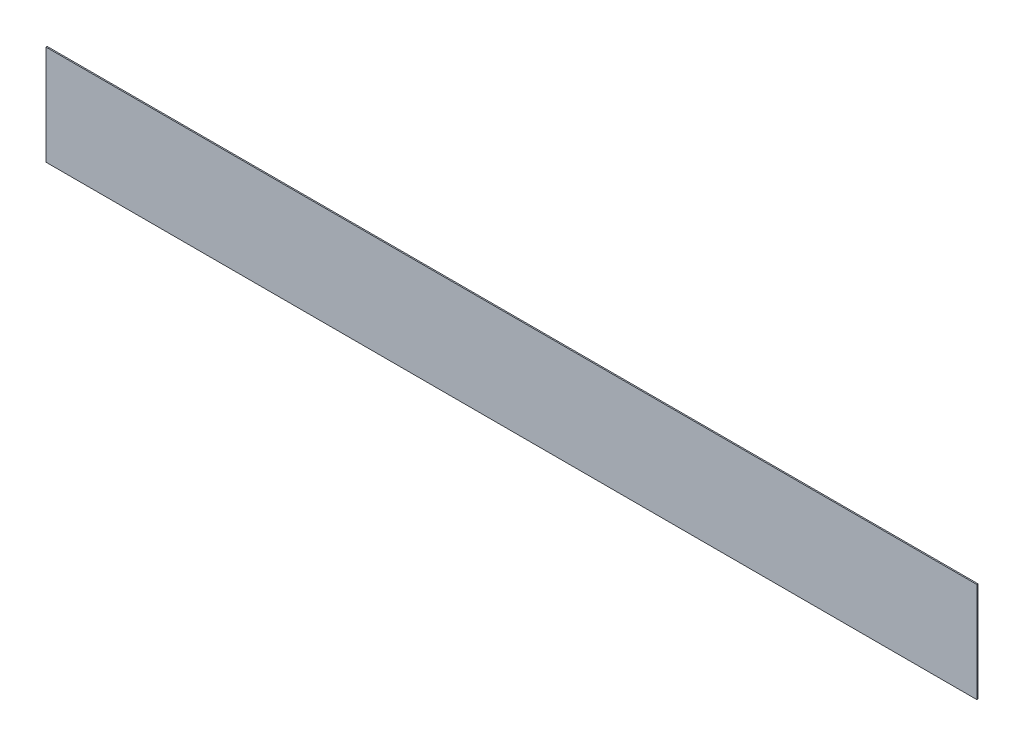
ISO-10303-21;
HEADER;
FILE_DESCRIPTION(('STEP AP214'),'2;1');
FILE_NAME('part.step','',(''),(''),'','','');
FILE_SCHEMA(('AUTOMOTIVE_DESIGN { 1 0 10303 214 1 1 1 1 }'));
ENDSEC;
DATA;
#1=APPLICATION_CONTEXT('core data for automotive mechanical design processes');
#2=APPLICATION_PROTOCOL_DEFINITION('international standard','automotive_design',2000,#1);
#3=PRODUCT_CONTEXT('',#1,'mechanical');
#4=PRODUCT('Part','Part','',(#3));
#5=PRODUCT_RELATED_PRODUCT_CATEGORY('part','',(#4));
#6=PRODUCT_DEFINITION_FORMATION('','',#4);
#7=PRODUCT_DEFINITION_CONTEXT('part definition',#1,'design');
#8=PRODUCT_DEFINITION('design','',#6,#7);
#9=PRODUCT_DEFINITION_SHAPE('','',#8);
#10=(LENGTH_UNIT() NAMED_UNIT(*) SI_UNIT(.MILLI.,.METRE.));
#11=(NAMED_UNIT(*) PLANE_ANGLE_UNIT() SI_UNIT($,.RADIAN.));
#12=(NAMED_UNIT(*) SI_UNIT($,.STERADIAN.) SOLID_ANGLE_UNIT());
#13=UNCERTAINTY_MEASURE_WITH_UNIT(LENGTH_MEASURE(1.E-05),#10,'distance_accuracy_value','');
#14=(GEOMETRIC_REPRESENTATION_CONTEXT(3) GLOBAL_UNCERTAINTY_ASSIGNED_CONTEXT((#13)) GLOBAL_UNIT_ASSIGNED_CONTEXT((#10,
#11,#12)) REPRESENTATION_CONTEXT('',''));
#15=CARTESIAN_POINT('',(0.,0.,0.));
#16=DIRECTION('',(0.,0.,1.));
#17=DIRECTION('',(1.,0.,0.));
#18=AXIS2_PLACEMENT_3D('',#15,#16,#17);
#19=CARTESIAN_POINT('',(-118.131068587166,38.8524363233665,2.));
#20=DIRECTION('',(1.,0.,0.));
#21=DIRECTION('',(0.,1.,0.));
#22=AXIS2_PLACEMENT_3D('',#19,#20,#21);
#23=PLANE('',#22);
#24=DIRECTION('',(0.,-1.,0.));
#25=VECTOR('',#24,1.);
#26=CARTESIAN_POINT('',(-118.131068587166,38.8524363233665,0.));
#27=LINE('',#26,#25);
#28=CARTESIAN_POINT('',(-118.131068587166,38.8524363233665,0.));
#29=VERTEX_POINT('',#28);
#30=CARTESIAN_POINT('',(-118.131068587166,-126.147563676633,0.));
#31=VERTEX_POINT('',#30);
#32=EDGE_CURVE('E95',#29,#31,#27,.T.);
#33=ORIENTED_EDGE('',*,*,#32,.T.);
#34=DIRECTION('',(0.,0.,-1.));
#35=VECTOR('',#34,1.);
#36=CARTESIAN_POINT('',(-118.131068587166,-126.147563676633,2.));
#37=LINE('',#36,#35);
#38=CARTESIAN_POINT('',(-118.131068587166,-126.147563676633,2.));
#39=VERTEX_POINT('',#38);
#40=EDGE_CURVE('E11',#39,#31,#37,.T.);
#41=ORIENTED_EDGE('',*,*,#40,.F.);
#42=DIRECTION('',(0.,-1.,0.));
#43=VECTOR('',#42,1.);
#44=CARTESIAN_POINT('',(-118.131068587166,38.8524363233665,2.));
#45=LINE('',#44,#43);
#46=CARTESIAN_POINT('',(-118.131068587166,38.8524363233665,2.));
#47=VERTEX_POINT('',#46);
#48=EDGE_CURVE('E83',#47,#39,#45,.T.);
#49=ORIENTED_EDGE('',*,*,#48,.F.);
#50=DIRECTION('',(0.,0.,-1.));
#51=VECTOR('',#50,1.);
#52=CARTESIAN_POINT('',(-118.131068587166,38.8524363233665,2.));
#53=LINE('',#52,#51);
#54=EDGE_CURVE('E91',#47,#29,#53,.T.);
#55=ORIENTED_EDGE('',*,*,#54,.T.);
#56=EDGE_LOOP('',(#33,#41,#49,#55));
#57=FACE_BOUND('',#56,.T.);
#58=ADVANCED_FACE('F32',(#57),#23,.F.);
#59=CARTESIAN_POINT('',(-118.131068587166,-126.147563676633,2.));
#60=DIRECTION('',(0.,1.,0.));
#61=DIRECTION('',(0.,0.,1.));
#62=AXIS2_PLACEMENT_3D('',#59,#60,#61);
#63=PLANE('',#62);
#64=DIRECTION('',(1.,0.,0.));
#65=VECTOR('',#64,1.);
#66=CARTESIAN_POINT('',(-118.131068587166,-126.147563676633,0.));
#67=LINE('',#66,#65);
#68=CARTESIAN_POINT('',(1421.86893141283,-126.147563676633,0.));
#69=VERTEX_POINT('',#68);
#70=EDGE_CURVE('E87',#31,#69,#67,.T.);
#71=ORIENTED_EDGE('',*,*,#70,.T.);
#72=DIRECTION('',(0.,0.,-1.));
#73=VECTOR('',#72,1.);
#74=CARTESIAN_POINT('',(1421.86893141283,-126.147563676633,2.));
#75=LINE('',#74,#73);
#76=CARTESIAN_POINT('',(1421.86893141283,-126.147563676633,2.));
#77=VERTEX_POINT('',#76);
#78=EDGE_CURVE('E40',#77,#69,#75,.T.);
#79=ORIENTED_EDGE('',*,*,#78,.F.);
#80=DIRECTION('',(1.,0.,0.));
#81=VECTOR('',#80,1.);
#82=CARTESIAN_POINT('',(-118.131068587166,-126.147563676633,2.));
#83=LINE('',#82,#81);
#84=EDGE_CURVE('E78',#39,#77,#83,.T.);
#85=ORIENTED_EDGE('',*,*,#84,.F.);
#86=ORIENTED_EDGE('',*,*,#40,.T.);
#87=EDGE_LOOP('',(#71,#79,#85,#86));
#88=FACE_BOUND('',#87,.T.);
#89=ADVANCED_FACE('F86',(#88),#63,.F.);
#90=CARTESIAN_POINT('',(1421.86893141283,38.8524363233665,2.));
#91=DIRECTION('',(-1.,0.,0.));
#92=DIRECTION('',(0.,0.,1.));
#93=AXIS2_PLACEMENT_3D('',#90,#91,#92);
#94=PLANE('',#93);
#95=DIRECTION('',(0.,1.,0.));
#96=VECTOR('',#95,1.);
#97=CARTESIAN_POINT('',(1421.86893141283,38.8524363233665,0.));
#98=LINE('',#97,#96);
#99=CARTESIAN_POINT('',(1421.86893141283,38.8524363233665,0.));
#100=VERTEX_POINT('',#99);
#101=EDGE_CURVE('E65',#69,#100,#98,.T.);
#102=ORIENTED_EDGE('',*,*,#101,.T.);
#103=DIRECTION('',(0.,0.,-1.));
#104=VECTOR('',#103,1.);
#105=CARTESIAN_POINT('',(1421.86893141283,38.8524363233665,2.));
#106=LINE('',#105,#104);
#107=CARTESIAN_POINT('',(1421.86893141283,38.8524363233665,2.));
#108=VERTEX_POINT('',#107);
#109=EDGE_CURVE('E88',#108,#100,#106,.T.);
#110=ORIENTED_EDGE('',*,*,#109,.F.);
#111=DIRECTION('',(0.,1.,0.));
#112=VECTOR('',#111,1.);
#113=CARTESIAN_POINT('',(1421.86893141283,38.8524363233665,2.));
#114=LINE('',#113,#112);
#115=EDGE_CURVE('E81',#77,#108,#114,.T.);
#116=ORIENTED_EDGE('',*,*,#115,.F.);
#117=ORIENTED_EDGE('',*,*,#78,.T.);
#118=EDGE_LOOP('',(#102,#110,#116,#117));
#119=FACE_BOUND('',#118,.T.);
#120=ADVANCED_FACE('F89',(#119),#94,.F.);
#121=CARTESIAN_POINT('',(-118.131068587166,38.8524363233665,2.));
#122=DIRECTION('',(0.,-1.,0.));
#123=DIRECTION('',(0.,0.,-1.));
#124=AXIS2_PLACEMENT_3D('',#121,#122,#123);
#125=PLANE('',#124);
#126=DIRECTION('',(-1.,0.,0.));
#127=VECTOR('',#126,1.);
#128=CARTESIAN_POINT('',(-118.131068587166,38.8524363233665,0.));
#129=LINE('',#128,#127);
#130=EDGE_CURVE('E71',#100,#29,#129,.T.);
#131=ORIENTED_EDGE('',*,*,#130,.T.);
#132=ORIENTED_EDGE('',*,*,#54,.F.);
#133=DIRECTION('',(-1.,0.,0.));
#134=VECTOR('',#133,1.);
#135=CARTESIAN_POINT('',(-118.131068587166,38.8524363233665,2.));
#136=LINE('',#135,#134);
#137=EDGE_CURVE('E48',#108,#47,#136,.T.);
#138=ORIENTED_EDGE('',*,*,#137,.F.);
#139=ORIENTED_EDGE('',*,*,#109,.T.);
#140=EDGE_LOOP('',(#131,#132,#138,#139));
#141=FACE_BOUND('',#140,.T.);
#142=ADVANCED_FACE('F102',(#141),#125,.F.);
#143=CARTESIAN_POINT('',(0.,0.,2.));
#144=DIRECTION('',(0.,0.,1.));
#145=DIRECTION('',(1.,0.,0.));
#146=AXIS2_PLACEMENT_3D('',#143,#144,#145);
#147=PLANE('',#146);
#148=ORIENTED_EDGE('',*,*,#48,.T.);
#149=ORIENTED_EDGE('',*,*,#84,.T.);
#150=ORIENTED_EDGE('',*,*,#115,.T.);
#151=ORIENTED_EDGE('',*,*,#137,.T.);
#152=EDGE_LOOP('',(#148,#149,#150,#151));
#153=FACE_BOUND('',#152,.T.);
#154=ADVANCED_FACE('F79',(#153),#147,.T.);
#155=CARTESIAN_POINT('',(0.,0.,0.));
#156=DIRECTION('',(0.,0.,1.));
#157=DIRECTION('',(1.,0.,0.));
#158=AXIS2_PLACEMENT_3D('',#155,#156,#157);
#159=PLANE('',#158);
#160=ORIENTED_EDGE('',*,*,#32,.F.);
#161=ORIENTED_EDGE('',*,*,#130,.F.);
#162=ORIENTED_EDGE('',*,*,#101,.F.);
#163=ORIENTED_EDGE('',*,*,#70,.F.);
#164=EDGE_LOOP('',(#160,#161,#162,#163));
#165=FACE_BOUND('',#164,.T.);
#166=ADVANCED_FACE('F105',(#165),#159,.F.);
#167=CLOSED_SHELL('',(#58,#89,#120,#142,#154,#166));
#168=MANIFOLD_SOLID_BREP('B2',#167);
#169=ADVANCED_BREP_SHAPE_REPRESENTATION('',(#18,#168),#14);
#170=SHAPE_DEFINITION_REPRESENTATION(#9,#169);
ENDSEC;
END-ISO-10303-21;
